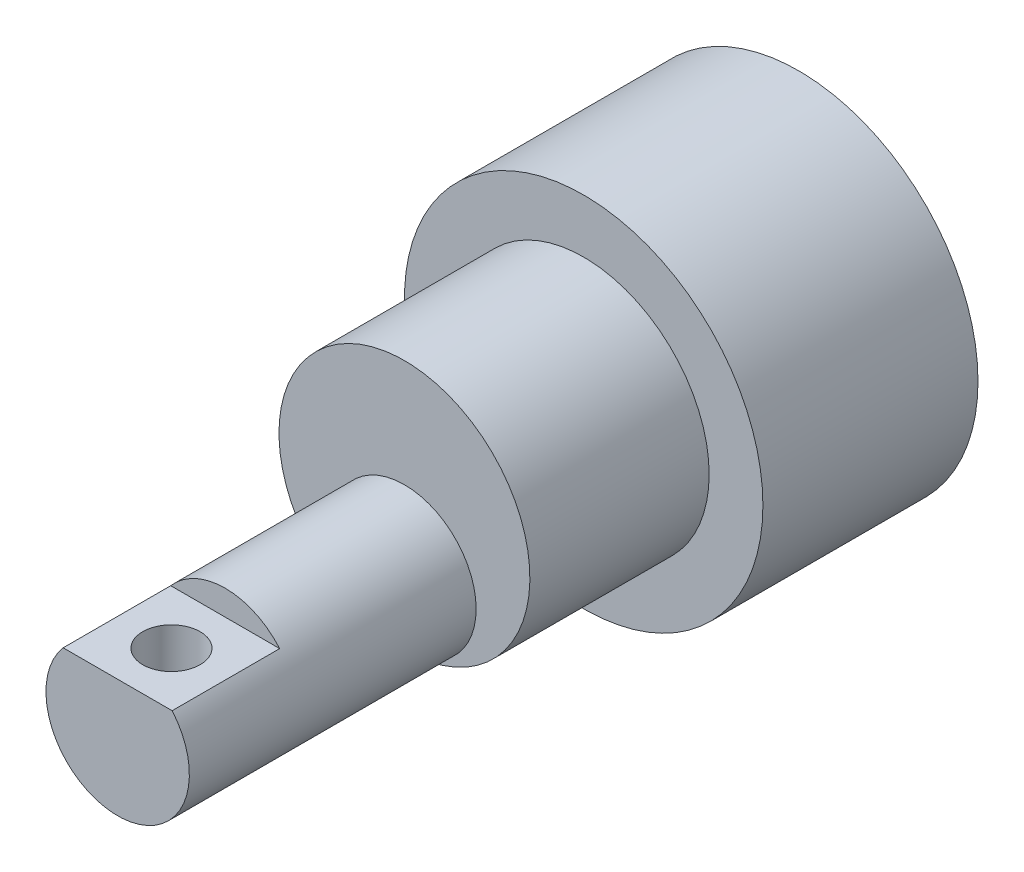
from build123d import *

# Parameters (mm, degrees)
SKETCH_1_R          = 50
EXTRUDE_1_DEPTH     = 60
SKETCH_2_R          = 35
EXTRUDE_2_DEPTH     = 50
SKETCH_3_R          = 20
EXTRUDE_3_DEPTH     = 80
SKETCH_4_W          = 40
SKETCH_4_H          = 30
CUT_EXTRUDE_1_DEPTH = 12
SKETCH_5_R          = 8
CUT_EXTRUDE_2_DEPTH = 204.233855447


with BuildPart() as part:
    # Sketch 1 → Extrude 1 (new body)
    with BuildSketch(Plane.XY):
        Circle(SKETCH_1_R)
    extrude(amount=EXTRUDE_1_DEPTH)

    # Sketch 2 → Extrude 2 (add)
    with BuildSketch(Plane.XY.offset(60)):
        Circle(SKETCH_2_R)
    extrude(amount=EXTRUDE_2_DEPTH)

    # Sketch 3 → Extrude 3 (add)
    with BuildSketch(Plane.XY.offset(110)):
        with Locations(Location((0, -15, 0), (0, 0, 270))):
            Circle(SKETCH_3_R)
    extrude(amount=EXTRUDE_3_DEPTH)

    # Sketch 4 → Cut-Extrude 1 (cut)
    with BuildSketch(Plane(origin=(0, 10, 0), x_dir=(1, 0, 0), z_dir=(0, 1, 0))):
        with Locations((0, -175)):
            Rectangle(SKETCH_4_W, SKETCH_4_H)
    extrude(amount=-CUT_EXTRUDE_1_DEPTH, mode=Mode.SUBTRACT)

    # Sketch 5 → Cut-Extrude 2 (cut, through all)
    with BuildSketch(Plane(origin=(0, -2, 0), x_dir=(1, 0, 0), z_dir=(0, 1, 0))):
        with Locations(Location((0, -175, 0), (0, 0, 270))):
            Circle(SKETCH_5_R)
    extrude(amount=-CUT_EXTRUDE_2_DEPTH, mode=Mode.SUBTRACT)


solid = part.part
